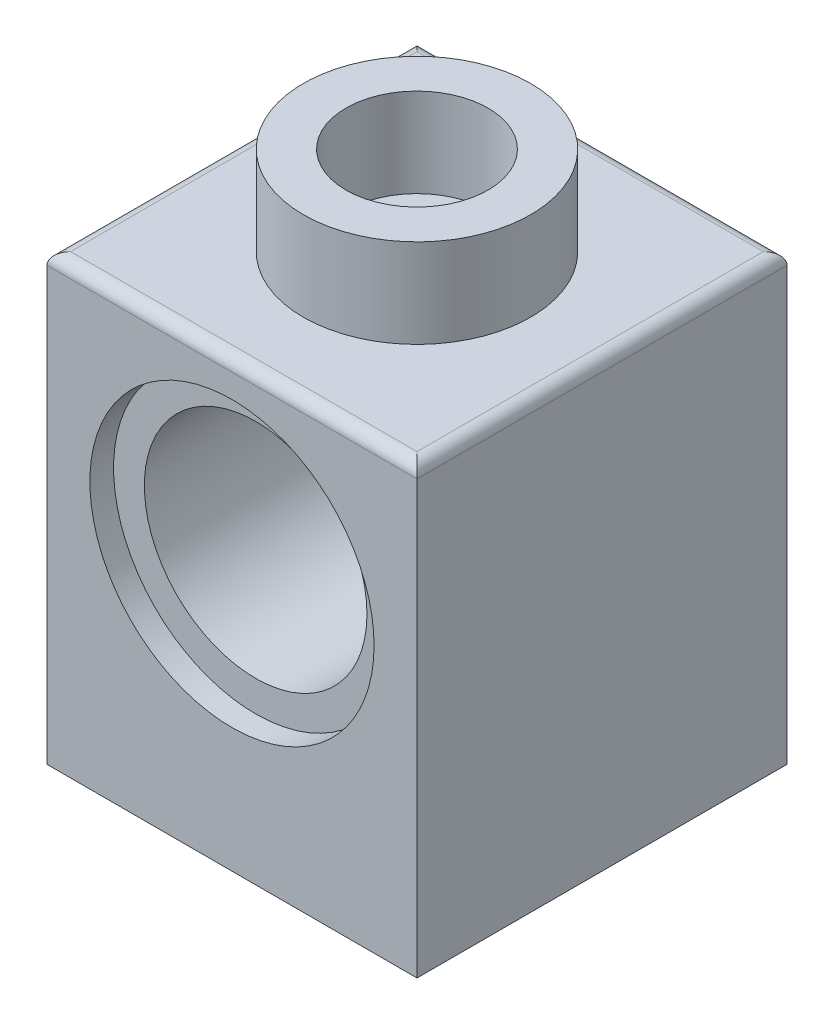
from build123d import *

# Parameters (mm, degrees)
SKETCH1_W                = 7.9375
SKETCH1_H                = 7.9375
BASE_EXTRUDE_DEPTH       = 9.525
SKETCH2_R                = 2.4384
BOSS_EXTRUDE1_DEPTH      = 1.905
SHELL1_T                 = -1.5875
SKETCH5_R                = 2.3876
CUT_EXTRUDE1_DEPTH       = 15.470652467
SKETCH6_R                = 3.048
CBORE1_DEPTH             = 0.508
CBORE2_START             = -0.762
SKETCH7_R                = 3.048
CBORE2_DEPTH             = 0.762
BOSS_EXTRUDE_THIN1_START = -5.842
SKETCH8_R                = 3.3876
SKETCH8_R_2              = 2.3876
BOSS_EXTRUDE_THIN1_DEPTH = 4.7625
INSDOT2_REACH            = 14.734
INSDOT2_END_RADIUS       = 3.3876
SKETCH4_R                = 1.27
CUT_EXTRUDE2_START       = -1.905
SKETCH10_R               = 1.524
CUT_EXTRUDE2_DEPTH       = 1.905
FILLET1_R                = 0.254


with BuildPart() as part:
    # Sketch1 → Base-Extrude (new body)
    with BuildSketch(Plane(origin=(0, 0, 0), x_dir=(1, 0, 0), z_dir=(0, 1, 0))):
        Rectangle(SKETCH1_W, SKETCH1_H)
    extrude(amount=BASE_EXTRUDE_DEPTH)

    # Sketch2 → Boss-Extrude1 (add)
    with BuildSketch(Plane(origin=(0, 9.525, 0), x_dir=(-1, 0, 0), z_dir=(0, 1, 0))):
        with Locations(Location((0, 0, 0), (0, 0, 270))):
            Circle(SKETCH2_R)
    extrude(amount=BOSS_EXTRUDE1_DEPTH)

    # Shell1
    shell1_openings = [part.faces().sort_by_distance(p)[0] for p in [
        (0, 0, 0),
    ]]
    offset(amount=SHELL1_T, openings=shell1_openings, kind=Kind.INTERSECTION)

    # Sketch5 → Cut-Extrude1 (cut, through all)
    with BuildSketch(Plane.XY.offset(3.96875)):
        with Locations((0, 5.715)):
            Circle(SKETCH5_R)
    extrude(amount=-CUT_EXTRUDE1_DEPTH, mode=Mode.SUBTRACT)

    # Sketch6 → cbore1 (cut)
    with BuildSketch(Plane.XY.offset(3.96875)):
        with Locations((0, 5.715)):
            Circle(SKETCH6_R)
    extrude(amount=-CBORE1_DEPTH, mode=Mode.SUBTRACT)

    # Sketch7 → cbore2 (cut)
    with BuildSketch(Plane(origin=(0, 0, -3.96875), x_dir=(-1, 0, 0), z_dir=(0, 0, -1)).offset(CBORE2_START)):
        with Locations(Location((0, 5.715, 0), (0, 0, 180))):
            Circle(SKETCH7_R)
    extrude(amount=CBORE2_DEPTH, mode=Mode.SUBTRACT)

    # Sketch8 → Boss-Extrude-Thin1 (add)
    with BuildSketch(Plane.XY.offset(3.46075).offset(BOSS_EXTRUDE_THIN1_START)):
        with Locations((0, 5.715)):
            Circle(SKETCH8_R)
        with Locations((0, 5.715)):
            Circle(SKETCH8_R_2, mode=Mode.SUBTRACT)
    extrude(amount=BOSS_EXTRUDE_THIN1_DEPTH)

    # InsDot2: up to this cylinder (the profile starts outside it)
    insdot2_end = Plane(origin=(0, 5.715, 0), z_dir=(0, 0, 1)) * Cylinder(INSDOT2_END_RADIUS, 37.2432, mode=Mode.PRIVATE)
    # Sketch4 → InsDot2 (add, up to the surface)
    with BuildSketch(Plane.XZ, mode=Mode.PRIVATE) as insdot2_sk1:
        with Locations(Location((0, 0, 0), (0, 0, 270))):
            Circle(SKETCH4_R)
    insdot2_tool1 = extrude(insdot2_sk1.sketch, amount=-INSDOT2_REACH, mode=Mode.PRIVATE) - insdot2_end
    add(insdot2_tool1.solids().sort_by_distance((0, 0, 0))[0])

    # Sketch10 → Cut-Extrude2 (cut)
    with BuildSketch(Plane(origin=(0, 11.43, 0), x_dir=(-1, 0, 0), z_dir=(0, 1, 0)).offset(CUT_EXTRUDE2_START)):
        with Locations(Location((0, 0, 0), (0, 0, 90))):
            Circle(SKETCH10_R)
    extrude(amount=CUT_EXTRUDE2_DEPTH, mode=Mode.SUBTRACT)

    # Fillet1
    fillet1_edges = [part.edges().sort_by_distance(p)[0] for p in [
        (3.96875, 9.525, 0),
        (0, 9.525, -3.96875),
        (-3.96875, 9.525, 0),
        (0, 9.525, 3.96875),
    ]]
    fillet(fillet1_edges, radius=FILLET1_R)


solid = part.part
